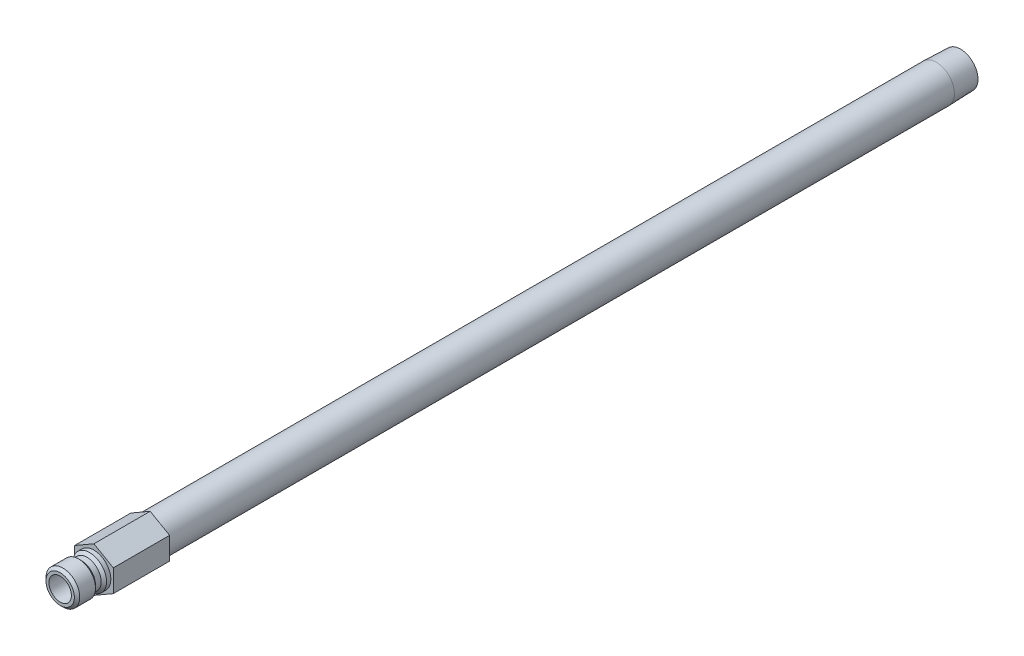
from build123d import *

# Parameters (mm, degrees)
SKETCH2_R           = 2.38125
BOSS_EXTRUDE1_DEPTH = 15.875


with BuildPart() as part:
    # Sketch1 → Revolve1 (revolve)
    with BuildSketch(Plane(origin=(0, 0, 0), x_dir=(0, 0, -1), z_dir=(1, 0, 0))):
        Polygon((-9.525, 3.175), (-9.525, 4.0005), (-8.763, 4.7625), (-4.318, 4.7625), (-3.556, 4.0005), (-1.9685, 4.0005), (-1.2065, 4.7625), (0, 4.7625), (0, 5.1435), (237.617, 5.1435), (244.475, 4.929188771), (244.475, 2.38125), (0.127, 2.38125), (0.127, 3.175), align=None)
    revolve(axis=Axis((0, 0, 0), (0, 0, 1)))

    # Sketch2 → Boss-Extrude1 (add)
    with BuildSketch(Plane.XY):
        Polygon((-5.461, 3.15290982), (-5.461, -3.15290982), (0, -6.30581964), (5.461, -3.15290982), (5.461, 3.15290982), (0, 6.30581964), align=None)
        with Locations(Location((0, 0, 0), (0, 0, 90))):
            Circle(SKETCH2_R, mode=Mode.SUBTRACT)
    extrude(amount=-BOSS_EXTRUDE1_DEPTH)


solid = part.part
